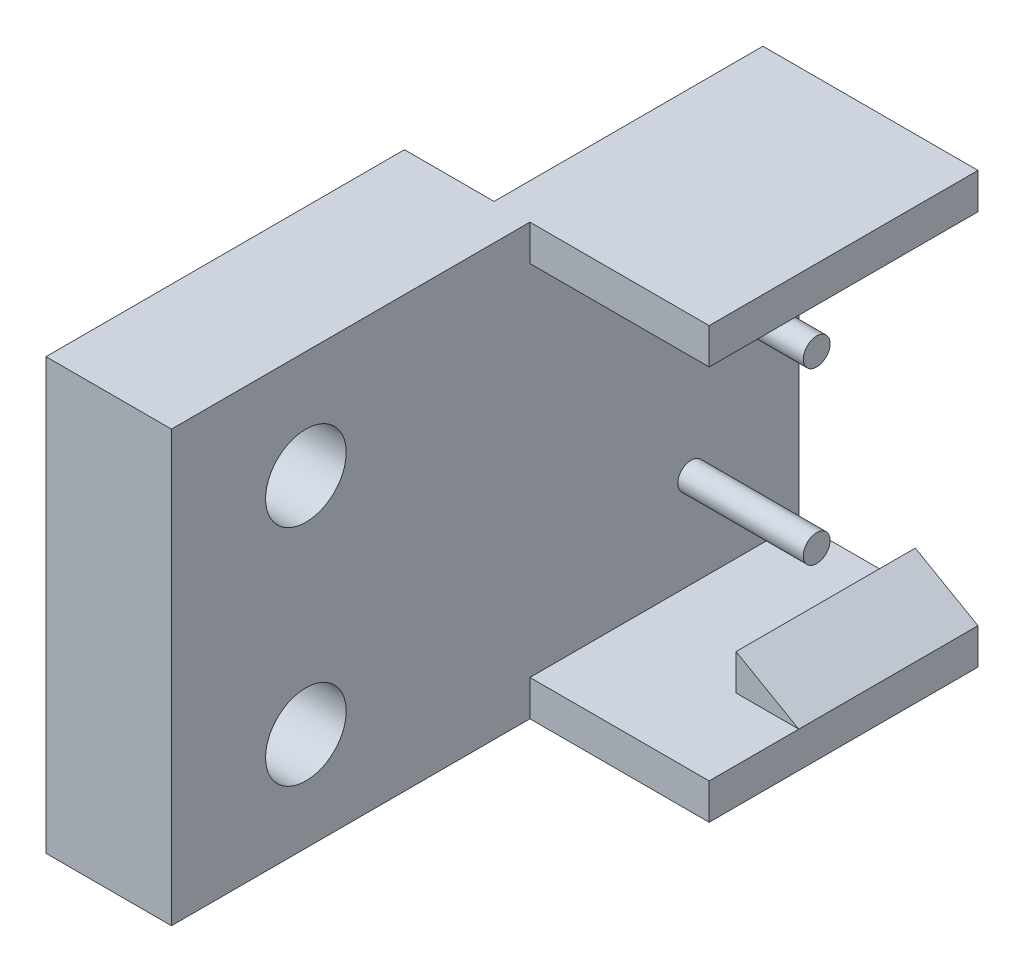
from build123d import *

# Parameters (mm, degrees)
SKIZZE1_W                            = 15
SKIZZE1_H                            = 24
AUFSATZ_LINEAR_AUSTRAGEN1_DEPTH      = 2
SKIZZE2_W                            = 15
SKIZZE2_H                            = 2
AUFSATZ_LINEAR_AUSTRAGEN2_DEPTH      = 10
AUFSATZ_LINEAR_AUSTRAGEN3_DEPTH      = 10
SKIZZE5_R                            = 0.75
AUFSATZ_LINEAR_AUSTRAGEN5_DEPTH      = 7
AUFSATZ_LINEAR_AUSTRAGEN7_DEPTH      = 5
AUFSATZ_LINEAR_AUSTRAGEN7_DEPTH_BACK = 2
SKIZZE10_W                           = 20
SKIZZE10_H                           = 24
SKIZZE10_R                           = 2.25


with BuildPart() as part:
    # Skizze1 → Aufsatz-Linear austragen1 (new body)
    with BuildSketch(Plane(origin=(0, 0, 0), x_dir=(0, 0, -1), z_dir=(1, 0, 0))):
        with Locations((7.5, 12)):
            Rectangle(SKIZZE1_W, SKIZZE1_H)
    extrude(amount=AUFSATZ_LINEAR_AUSTRAGEN1_DEPTH)

    # Skizze2 → Aufsatz-Linear austragen2 (add)
    with BuildSketch(Plane(origin=(2, 0, 0), x_dir=(0, 0, -1), z_dir=(1, 0, 0))):
        with Locations((7.5, 23)):
            Rectangle(SKIZZE2_W, SKIZZE2_H)
        with Locations((7.5, 1)):
            Rectangle(SKIZZE2_W, SKIZZE2_H)
    extrude(amount=AUFSATZ_LINEAR_AUSTRAGEN2_DEPTH)

    # Skizze3 → Aufsatz-Linear austragen3 (add)
    with BuildSketch(Plane(origin=(0, 0, -15), x_dir=(-1, 0, 0), z_dir=(0, 0, -1))):
        Polygon((-12, 22), (-8.5, 20), (-8.5, 22), align=None)
        Polygon((-12, 2), (-8.5, 4), (-8.5, 2), align=None)
    extrude(amount=-AUFSATZ_LINEAR_AUSTRAGEN3_DEPTH)

    # Skizze5 → Aufsatz-Linear austragen5 (add)
    with BuildSketch(Plane(origin=(2, 0, 0), x_dir=(0, 0, -1), z_dir=(1, 0, 0))):
        with Locations(Location((9, 16.75, 0), (0, 0, 180))):
            Circle(SKIZZE5_R)
        with Locations(Location((9, 7.25, 0), (0, 0, 180))):
            Circle(SKIZZE5_R)
    extrude(amount=AUFSATZ_LINEAR_AUSTRAGEN5_DEPTH)

    # Skizze10 → Aufsatz-Linear austragen7 (add, two sides: drawn at the far end of the back side and taken through both)
    with BuildSketch(Plane.ZY.offset(-AUFSATZ_LINEAR_AUSTRAGEN7_DEPTH_BACK)):
        with Locations((10, 12)):
            Rectangle(SKIZZE10_W, SKIZZE10_H)
        with Locations((12.5, 18)):
            Circle(SKIZZE10_R, mode=Mode.SUBTRACT)
        with Locations((12.5, 5.5)):
            Circle(SKIZZE10_R, mode=Mode.SUBTRACT)
    extrude(amount=AUFSATZ_LINEAR_AUSTRAGEN7_DEPTH + AUFSATZ_LINEAR_AUSTRAGEN7_DEPTH_BACK)


solid = part.part
